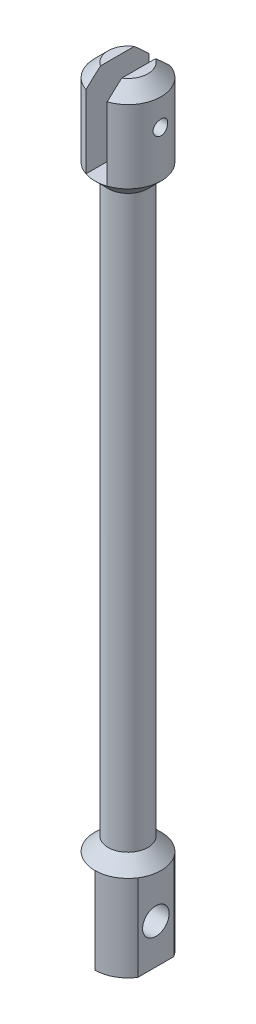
ISO-10303-21;
HEADER;
FILE_DESCRIPTION(('STEP AP214'),'2;1');
FILE_NAME('part.step','',(''),(''),'','','');
FILE_SCHEMA(('AUTOMOTIVE_DESIGN { 1 0 10303 214 1 1 1 1 }'));
ENDSEC;
DATA;
#1=APPLICATION_CONTEXT('core data for automotive mechanical design processes');
#2=APPLICATION_PROTOCOL_DEFINITION('international standard','automotive_design',2000,#1);
#3=PRODUCT_CONTEXT('',#1,'mechanical');
#4=PRODUCT('Part','Part','',(#3));
#5=PRODUCT_RELATED_PRODUCT_CATEGORY('part','',(#4));
#6=PRODUCT_DEFINITION_FORMATION('','',#4);
#7=PRODUCT_DEFINITION_CONTEXT('part definition',#1,'design');
#8=PRODUCT_DEFINITION('design','',#6,#7);
#9=PRODUCT_DEFINITION_SHAPE('','',#8);
#10=(LENGTH_UNIT() NAMED_UNIT(*) SI_UNIT(.MILLI.,.METRE.));
#11=(NAMED_UNIT(*) PLANE_ANGLE_UNIT() SI_UNIT($,.RADIAN.));
#12=(NAMED_UNIT(*) SI_UNIT($,.STERADIAN.) SOLID_ANGLE_UNIT());
#13=UNCERTAINTY_MEASURE_WITH_UNIT(LENGTH_MEASURE(1.E-05),#10,'distance_accuracy_value','');
#14=(GEOMETRIC_REPRESENTATION_CONTEXT(3) GLOBAL_UNCERTAINTY_ASSIGNED_CONTEXT((#13)) GLOBAL_UNIT_ASSIGNED_CONTEXT((#10,
#11,#12)) REPRESENTATION_CONTEXT('',''));
#15=CARTESIAN_POINT('',(0.,0.,0.));
#16=DIRECTION('',(0.,0.,1.));
#17=DIRECTION('',(1.,0.,0.));
#18=AXIS2_PLACEMENT_3D('',#15,#16,#17);
#19=CARTESIAN_POINT('',(0.8,51.5,2.368543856));
#20=DIRECTION('',(1.,0.,0.));
#21=DIRECTION('',(0.,0.,-1.));
#22=AXIS2_PLACEMENT_3D('',#19,#20,#21);
#23=PLANE('',#22);
#24=DIRECTION('',(0.,0.,1.));
#25=VECTOR('',#24,1.);
#26=CARTESIAN_POINT('',(0.8,58.,0.));
#27=LINE('',#26,#25);
#28=CARTESIAN_POINT('',(0.8,58.0000000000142,-1.26885775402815));
#29=VERTEX_POINT('',#28);
#30=CARTESIAN_POINT('',(0.8,58.,1.26885775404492));
#31=VERTEX_POINT('',#30);
#32=EDGE_CURVE('E185',#29,#31,#27,.T.);
#33=ORIENTED_EDGE('',*,*,#32,.F.);
#34=CARTESIAN_POINT('',(0.8,58.0000000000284,-1.26885775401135));
#35=CARTESIAN_POINT('',(0.8,57.9599805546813,-1.31615088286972));
#36=CARTESIAN_POINT('',(0.8,57.9196090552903,-1.36314265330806));
#37=CARTESIAN_POINT('',(0.8,57.8383030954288,-1.45663280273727));
#38=CARTESIAN_POINT('',(0.8,57.7973686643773,-1.50313120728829));
#39=CARTESIAN_POINT('',(0.8,57.6739404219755,-1.64204184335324));
#40=CARTESIAN_POINT('',(0.8,57.5908078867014,-1.73388558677));
#41=CARTESIAN_POINT('',(0.8,57.4234828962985,-1.91657711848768));
#42=CARTESIAN_POINT('',(0.8,57.3392905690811,-2.00742502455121));
#43=CARTESIAN_POINT('',(0.8,57.1701383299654,-2.18843350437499));
#44=CARTESIAN_POINT('',(0.8,57.0851782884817,-2.27859395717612));
#45=CARTESIAN_POINT('',(0.8,56.9999999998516,-2.36854385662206));
#46=B_SPLINE_CURVE_WITH_KNOTS('',3,(#34,#35,#36,#37,#38,#39,#40,#41,#42,#43,#44,#45),
.UNSPECIFIED.,.F.,.F.,(4,2,2,2,2,4),(0.,0.185853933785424,0.371698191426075,0.743323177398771,
1.11490373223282,1.48654822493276),.UNSPECIFIED.);
#47=CARTESIAN_POINT('',(0.799999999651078,56.9999999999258,-2.36854385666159));
#48=VERTEX_POINT('',#47);
#49=EDGE_CURVE('E269',#29,#48,#46,.T.);
#50=ORIENTED_EDGE('',*,*,#49,.T.);
#51=DIRECTION('',(0.,1.,0.));
#52=VECTOR('',#51,1.);
#53=CARTESIAN_POINT('',(0.799999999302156,54.25,-2.36854385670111));
#54=LINE('',#53,#52);
#55=CARTESIAN_POINT('',(0.800000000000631,51.5,-2.36854385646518));
#56=VERTEX_POINT('',#55);
#57=EDGE_CURVE('E423',#48,#56,#54,.F.);
#58=ORIENTED_EDGE('',*,*,#57,.T.);
#59=DIRECTION('',(0.,0.,-1.));
#60=VECTOR('',#59,1.);
#61=CARTESIAN_POINT('',(0.8,51.5,0.));
#62=LINE('',#61,#60);
#63=CARTESIAN_POINT('',(0.800000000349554,51.5,2.36854385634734));
#64=VERTEX_POINT('',#63);
#65=EDGE_CURVE('E191',#64,#56,#62,.T.);
#66=ORIENTED_EDGE('',*,*,#65,.F.);
#67=DIRECTION('',(0.,-1.,0.));
#68=VECTOR('',#67,1.);
#69=CARTESIAN_POINT('',(0.800000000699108,54.25,2.36854385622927));
#70=LINE('',#69,#68);
#71=CARTESIAN_POINT('',(0.800000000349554,57.0000000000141,2.36854385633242));
#72=VERTEX_POINT('',#71);
#73=EDGE_CURVE('E437',#64,#72,#70,.F.);
#74=ORIENTED_EDGE('',*,*,#73,.T.);
#75=CARTESIAN_POINT('',(0.800000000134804,57.000000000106,2.36854385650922));
#76=CARTESIAN_POINT('',(0.800000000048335,57.0851782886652,2.27859395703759));
#77=CARTESIAN_POINT('',(0.800000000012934,57.1701383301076,2.18843350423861));
#78=CARTESIAN_POINT('',(0.799999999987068,57.3392905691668,2.00742502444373));
#79=CARTESIAN_POINT('',(0.799999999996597,57.4234828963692,1.91657711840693));
#80=CARTESIAN_POINT('',(0.800000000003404,57.5908078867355,1.73388558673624));
#81=CARTESIAN_POINT('',(0.800000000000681,57.6739404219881,1.64204184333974));
#82=CARTESIAN_POINT('',(0.79999999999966,57.7973686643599,1.50313120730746));
#83=CARTESIAN_POINT('',(0.79999999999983,57.8383030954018,1.45663280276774));
#84=CARTESIAN_POINT('',(0.80000000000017,57.9196090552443,1.36314265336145));
#85=CARTESIAN_POINT('',(0.800000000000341,57.959980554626,1.31615088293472));
#86=CARTESIAN_POINT('',(0.8,57.9999999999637,1.26885775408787));
#87=B_SPLINE_CURVE_WITH_KNOTS('',3,(#75,#76,#77,#78,#79,#80,#81,#82,#83,#84,#85,#86),
.UNSPECIFIED.,.F.,.F.,(4,2,2,2,2,4),(0.,0.3716444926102,0.743225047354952,1.11485003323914,
1.30069429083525,1.486548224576),.UNSPECIFIED.);
#88=EDGE_CURVE('E274',#72,#31,#87,.T.);
#89=ORIENTED_EDGE('',*,*,#88,.T.);
#90=EDGE_LOOP('',(#33,#50,#58,#66,#74,#89));
#91=FACE_BOUND('',#90,.T.);
#92=CARTESIAN_POINT('',(0.799999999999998,55.,0.));
#93=DIRECTION('',(-1.,0.,0.));
#94=DIRECTION('',(0.,0.,1.));
#95=AXIS2_PLACEMENT_3D('',#92,#93,#94);
#96=CIRCLE('',#95,0.549999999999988);
#97=CARTESIAN_POINT('',(0.799999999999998,55.,0.549999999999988));
#98=VERTEX_POINT('',#97);
#99=EDGE_CURVE('E361',#98,#98,#96,.T.);
#100=ORIENTED_EDGE('',*,*,#99,.F.);
#101=EDGE_LOOP('',(#100));
#102=FACE_BOUND('',#101,.T.);
#103=ADVANCED_FACE('F42',(#91,#102),#23,.F.);
#104=CARTESIAN_POINT('',(2.1,6.5,1.372743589));
#105=DIRECTION('',(0.,-1.,0.));
#106=DIRECTION('',(0.,0.,-1.));
#107=AXIS2_PLACEMENT_3D('',#104,#105,#106);
#108=PLANE('',#107);
#109=DIRECTION('',(0.,0.,1.));
#110=VECTOR('',#109,1.);
#111=CARTESIAN_POINT('',(2.1,6.5,1.35646599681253));
#112=LINE('',#111,#110);
#113=CARTESIAN_POINT('',(2.1,6.5,-1.35646599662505));
#114=VERTEX_POINT('',#113);
#115=CARTESIAN_POINT('',(2.1,6.5,1.35646599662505));
#116=VERTEX_POINT('',#115);
#117=EDGE_CURVE('E63',#114,#116,#112,.T.);
#118=ORIENTED_EDGE('',*,*,#117,.F.);
#119=CARTESIAN_POINT('',(0.,6.5,0.));
#120=DIRECTION('',(0.,-1.,0.));
#121=DIRECTION('',(0.,0.,-1.));
#122=AXIS2_PLACEMENT_3D('',#119,#120,#121);
#123=CIRCLE('',#122,2.5);
#124=EDGE_CURVE('E56',#116,#114,#123,.F.);
#125=ORIENTED_EDGE('',*,*,#124,.F.);
#126=EDGE_LOOP('',(#118,#125));
#127=FACE_BOUND('',#126,.T.);
#128=ADVANCED_FACE('F266',(#127),#108,.T.);
#129=CARTESIAN_POINT('',(-1.5042,58.,-1.284084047));
#130=DIRECTION('',(0.,1.,0.));
#131=DIRECTION('',(0.,0.,1.));
#132=AXIS2_PLACEMENT_3D('',#129,#130,#131);
#133=PLANE('',#132);
#134=CARTESIAN_POINT('',(0.,58.,0.));
#135=DIRECTION('',(0.,-1.,0.));
#136=DIRECTION('',(0.,0.,-1.));
#137=AXIS2_PLACEMENT_3D('',#134,#135,#136);
#138=CIRCLE('',#137,1.49999999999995);
#139=CARTESIAN_POINT('',(-0.8,57.9999999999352,-1.26885775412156));
#140=VERTEX_POINT('',#139);
#141=CARTESIAN_POINT('',(-0.8,58.,1.26885775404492));
#142=VERTEX_POINT('',#141);
#143=EDGE_CURVE('E325',#140,#142,#138,.F.);
#144=ORIENTED_EDGE('',*,*,#143,.T.);
#145=DIRECTION('',(0.,0.,1.));
#146=VECTOR('',#145,1.);
#147=CARTESIAN_POINT('',(-0.8,58.,0.));
#148=LINE('',#147,#146);
#149=EDGE_CURVE('E242',#140,#142,#148,.T.);
#150=ORIENTED_EDGE('',*,*,#149,.F.);
#151=EDGE_LOOP('',(#144,#150));
#152=FACE_BOUND('',#151,.T.);
#153=ADVANCED_FACE('F385',(#152),#133,.T.);
#154=CARTESIAN_POINT('',(-0.8,51.5,-2.53));
#155=DIRECTION('',(0.,1.,0.));
#156=DIRECTION('',(0.,0.,1.));
#157=AXIS2_PLACEMENT_3D('',#154,#155,#156);
#158=PLANE('',#157);
#159=ORIENTED_EDGE('',*,*,#65,.T.);
#160=CARTESIAN_POINT('',(0.,51.5,0.));
#161=DIRECTION('',(0.,1.,0.));
#162=DIRECTION('',(-1.,0.,0.));
#163=AXIS2_PLACEMENT_3D('',#160,#161,#162);
#164=CIRCLE('',#163,2.49999999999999);
#165=CARTESIAN_POINT('',(-0.800000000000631,51.5,-2.36854385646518));
#166=VERTEX_POINT('',#165);
#167=EDGE_CURVE('E150',#56,#166,#164,.T.);
#168=ORIENTED_EDGE('',*,*,#167,.T.);
#169=DIRECTION('',(0.,0.,-1.));
#170=VECTOR('',#169,1.);
#171=CARTESIAN_POINT('',(-0.8,51.5,0.));
#172=LINE('',#171,#170);
#173=CARTESIAN_POINT('',(-0.80000000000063,51.5,2.36854385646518));
#174=VERTEX_POINT('',#173);
#175=EDGE_CURVE('E317',#174,#166,#172,.T.);
#176=ORIENTED_EDGE('',*,*,#175,.F.);
#177=CARTESIAN_POINT('',(0.,51.5,0.));
#178=DIRECTION('',(0.,1.,0.));
#179=DIRECTION('',(-1.,0.,0.));
#180=AXIS2_PLACEMENT_3D('',#177,#178,#179);
#181=CIRCLE('',#180,2.49999999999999);
#182=EDGE_CURVE('E147',#174,#64,#181,.T.);
#183=ORIENTED_EDGE('',*,*,#182,.T.);
#184=EDGE_LOOP('',(#159,#168,#176,#183));
#185=FACE_BOUND('',#184,.T.);
#186=ADVANCED_FACE('F411',(#185),#158,.T.);
#187=CARTESIAN_POINT('',(0.8,58.,-1.284084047));
#188=DIRECTION('',(0.,1.,0.));
#189=DIRECTION('',(0.,0.,1.));
#190=AXIS2_PLACEMENT_3D('',#187,#188,#189);
#191=PLANE('',#190);
#192=ORIENTED_EDGE('',*,*,#32,.T.);
#193=CARTESIAN_POINT('',(0.,58.,0.));
#194=DIRECTION('',(0.,-1.,0.));
#195=DIRECTION('',(0.,0.,-1.));
#196=AXIS2_PLACEMENT_3D('',#193,#194,#195);
#197=CIRCLE('',#196,1.49999999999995);
#198=EDGE_CURVE('E190',#31,#29,#197,.F.);
#199=ORIENTED_EDGE('',*,*,#198,.T.);
#200=EDGE_LOOP('',(#192,#199));
#201=FACE_BOUND('',#200,.T.);
#202=ADVANCED_FACE('F261',(#201),#191,.T.);
#203=CARTESIAN_POINT('',(0.,58.,0.));
#204=DIRECTION('',(0.,-1.,0.));
#205=DIRECTION('',(0.,0.,-1.));
#206=AXIS2_PLACEMENT_3D('',#203,#204,#205);
#207=CONICAL_SURFACE('',#206,1.5,0.785398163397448);
#208=CARTESIAN_POINT('',(-0.799999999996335,57.9999999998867,1.26885775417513));
#209=CARTESIAN_POINT('',(-0.799999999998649,57.9599805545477,1.31615088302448));
#210=CARTESIAN_POINT('',(-0.79999999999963,57.9196090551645,1.36314265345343));
#211=CARTESIAN_POINT('',(-0.80000000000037,57.8383030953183,1.45663280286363));
#212=CARTESIAN_POINT('',(-0.80000000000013,57.7973686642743,1.50313120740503));
#213=CARTESIAN_POINT('',(-0.799999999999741,57.6739404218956,1.6420418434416));
#214=CARTESIAN_POINT('',(-0.799999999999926,57.5908078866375,1.73388558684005));
#215=CARTESIAN_POINT('',(-0.800000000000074,57.4234828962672,1.91657711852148));
#216=CARTESIAN_POINT('',(-0.800000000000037,57.3392905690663,2.00742502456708));
#217=CARTESIAN_POINT('',(-0.799999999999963,57.1701383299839,2.18843350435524));
#218=CARTESIAN_POINT('',(-0.799999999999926,57.0851782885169,2.27859395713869));
#219=CARTESIAN_POINT('',(-0.8,56.9999999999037,2.36854385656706));
#220=B_SPLINE_CURVE_WITH_KNOTS('',3,(#208,#209,#210,#211,#212,#213,#214,#215,#216,#217,#218,
#219),.UNSPECIFIED.,.F.,.F.,(4,2,2,2,2,4),(0.,0.185853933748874,0.371698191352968,
0.743323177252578,1.11490373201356,1.48654822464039),.UNSPECIFIED.);
#221=CARTESIAN_POINT('',(-0.800000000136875,56.9999999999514,2.36854385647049));
#222=VERTEX_POINT('',#221);
#223=EDGE_CURVE('E232',#142,#222,#220,.T.);
#224=ORIENTED_EDGE('',*,*,#223,.F.);
#225=ORIENTED_EDGE('',*,*,#143,.F.);
#226=CARTESIAN_POINT('',(-0.8,56.9999999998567,-2.36854385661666));
#227=CARTESIAN_POINT('',(-0.8,57.0851782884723,-2.27859395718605));
#228=CARTESIAN_POINT('',(-0.8,57.1701383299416,-2.18843350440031));
#229=CARTESIAN_POINT('',(-0.8,57.3392905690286,-2.00742502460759));
#230=CARTESIAN_POINT('',(-0.8,57.4234828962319,-1.91657711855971));
#231=CARTESIAN_POINT('',(-0.8,57.5908078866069,-1.73388558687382));
#232=CARTESIAN_POINT('',(-0.8,57.6739404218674,-1.64204184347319));
#233=CARTESIAN_POINT('',(-0.8,57.7973686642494,-1.50313120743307));
#234=CARTESIAN_POINT('',(-0.8,57.8383030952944,-1.45663280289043));
#235=CARTESIAN_POINT('',(-0.8,57.9196090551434,-1.3631426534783));
#236=CARTESIAN_POINT('',(-0.8,57.9599805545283,-1.31615088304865));
#237=CARTESIAN_POINT('',(-0.8,57.9999999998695,-1.26885775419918));
#238=B_SPLINE_CURVE_WITH_KNOTS('',3,(#226,#227,#228,#229,#230,#231,#232,#233,#234,#235,#236,
#237),.UNSPECIFIED.,.F.,.F.,(4,2,2,2,2,4),(0.,0.371644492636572,0.743225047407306,
1.11485003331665,1.30069429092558,1.4865482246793),.UNSPECIFIED.);
#239=CARTESIAN_POINT('',(-0.799999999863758,56.9999999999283,-2.36854385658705));
#240=VERTEX_POINT('',#239);
#241=EDGE_CURVE('E244',#240,#140,#238,.T.);
#242=ORIENTED_EDGE('',*,*,#241,.F.);
#243=CARTESIAN_POINT('',(0.,57.,0.));
#244=DIRECTION('',(0.,-1.,0.));
#245=DIRECTION('',(0.,0.,-1.));
#246=AXIS2_PLACEMENT_3D('',#243,#244,#245);
#247=CIRCLE('',#246,2.5);
#248=EDGE_CURVE('E424',#240,#222,#247,.F.);
#249=ORIENTED_EDGE('',*,*,#248,.T.);
#250=EDGE_LOOP('',(#224,#225,#242,#249));
#251=FACE_BOUND('',#250,.T.);
#252=ADVANCED_FACE('F251',(#251),#207,.T.);
#253=CARTESIAN_POINT('',(-0.8,51.5,2.368543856));
#254=DIRECTION('',(1.,0.,0.));
#255=DIRECTION('',(0.,0.,-1.));
#256=AXIS2_PLACEMENT_3D('',#253,#254,#255);
#257=PLANE('',#256);
#258=CARTESIAN_POINT('',(-0.799999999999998,55.,0.));
#259=DIRECTION('',(1.,0.,0.));
#260=DIRECTION('',(0.,0.,-1.));
#261=AXIS2_PLACEMENT_3D('',#258,#259,#260);
#262=CIRCLE('',#261,0.549999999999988);
#263=CARTESIAN_POINT('',(-0.799999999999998,55.,-0.549999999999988));
#264=VERTEX_POINT('',#263);
#265=EDGE_CURVE('E628',#264,#264,#262,.T.);
#266=ORIENTED_EDGE('',*,*,#265,.F.);
#267=EDGE_LOOP('',(#266));
#268=FACE_BOUND('',#267,.T.);
#269=ORIENTED_EDGE('',*,*,#149,.T.);
#270=ORIENTED_EDGE('',*,*,#223,.T.);
#271=DIRECTION('',(0.,1.,0.));
#272=VECTOR('',#271,1.);
#273=CARTESIAN_POINT('',(-0.800000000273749,54.25,2.36854385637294));
#274=LINE('',#273,#272);
#275=EDGE_CURVE('E417',#222,#174,#274,.F.);
#276=ORIENTED_EDGE('',*,*,#275,.T.);
#277=ORIENTED_EDGE('',*,*,#175,.T.);
#278=DIRECTION('',(0.,-1.,0.));
#279=VECTOR('',#278,1.);
#280=CARTESIAN_POINT('',(-0.799999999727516,54.25,-2.36854385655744));
#281=LINE('',#280,#279);
#282=EDGE_CURVE('E281',#166,#240,#281,.F.);
#283=ORIENTED_EDGE('',*,*,#282,.T.);
#284=ORIENTED_EDGE('',*,*,#241,.T.);
#285=EDGE_LOOP('',(#269,#270,#276,#277,#283,#284));
#286=FACE_BOUND('',#285,.T.);
#287=ADVANCED_FACE('F255',(#268,#286),#257,.T.);
#288=CARTESIAN_POINT('',(0.,58.,0.));
#289=DIRECTION('',(0.,-1.,0.));
#290=DIRECTION('',(0.,0.,-1.));
#291=AXIS2_PLACEMENT_3D('',#288,#289,#290);
#292=CONICAL_SURFACE('',#291,1.5,0.785398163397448);
#293=CARTESIAN_POINT('',(0.,57.,0.));
#294=DIRECTION('',(0.,-1.,0.));
#295=DIRECTION('',(0.,0.,-1.));
#296=AXIS2_PLACEMENT_3D('',#293,#294,#295);
#297=CIRCLE('',#296,2.5);
#298=EDGE_CURVE('E192',#72,#48,#297,.F.);
#299=ORIENTED_EDGE('',*,*,#298,.T.);
#300=ORIENTED_EDGE('',*,*,#49,.F.);
#301=ORIENTED_EDGE('',*,*,#198,.F.);
#302=ORIENTED_EDGE('',*,*,#88,.F.);
#303=EDGE_LOOP('',(#299,#300,#301,#302));
#304=FACE_BOUND('',#303,.T.);
#305=ADVANCED_FACE('F259',(#304),#292,.T.);
#306=CARTESIAN_POINT('',(0.,57.,0.));
#307=DIRECTION('',(0.,-1.,0.));
#308=DIRECTION('',(1.,0.,0.));
#309=AXIS2_PLACEMENT_3D('',#306,#307,#308);
#310=CYLINDRICAL_SURFACE('',#309,2.5);
#311=CARTESIAN_POINT('',(-2.43874967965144,55.,-0.549999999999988));
#312=CARTESIAN_POINT('',(-2.43875029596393,55.0304899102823,-0.549998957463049));
#313=CARTESIAN_POINT('',(-2.43932769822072,55.0609923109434,-0.54745600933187));
#314=CARTESIAN_POINT('',(-2.44157061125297,55.1211293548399,-0.537362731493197));
#315=CARTESIAN_POINT('',(-2.4432369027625,55.1507633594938,-0.529808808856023));
#316=CARTESIAN_POINT('',(-2.44745995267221,55.2082850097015,-0.509943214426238));
#317=CARTESIAN_POINT('',(-2.45001572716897,55.2361745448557,-0.497636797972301));
#318=CARTESIAN_POINT('',(-2.45572858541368,55.2894938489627,-0.468630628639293));
#319=CARTESIAN_POINT('',(-2.45888565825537,55.314923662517,-0.451930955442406));
#320=CARTESIAN_POINT('',(-2.46550566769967,55.3630365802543,-0.414308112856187));
#321=CARTESIAN_POINT('',(-2.46897255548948,55.3856715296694,-0.393324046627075));
#322=CARTESIAN_POINT('',(-2.47578698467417,55.4271303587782,-0.347859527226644));
#323=CARTESIAN_POINT('',(-2.47913451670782,55.4459539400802,-0.32337880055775));
#324=CARTESIAN_POINT('',(-2.4853761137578,55.4794464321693,-0.271292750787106));
#325=CARTESIAN_POINT('',(-2.48826497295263,55.4940689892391,-0.243656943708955));
#326=CARTESIAN_POINT('',(-2.49321907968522,55.5184444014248,-0.186246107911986));
#327=CARTESIAN_POINT('',(-2.49528442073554,55.5281978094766,-0.156471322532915));
#328=CARTESIAN_POINT('',(-2.49833086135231,55.5424064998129,-0.096128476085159));
#329=CARTESIAN_POINT('',(-2.49932862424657,55.5469432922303,-0.0655804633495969));
#330=CARTESIAN_POINT('',(-2.50018523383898,55.5508448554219,-0.00414172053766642));
#331=CARTESIAN_POINT('',(-2.50004421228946,55.5502102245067,0.026748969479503));
#332=CARTESIAN_POINT('',(-2.49865186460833,55.5438475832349,0.0874341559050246));
#333=CARTESIAN_POINT('',(-2.49741969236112,55.5382074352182,0.11723836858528));
#334=CARTESIAN_POINT('',(-2.49400533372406,55.5221339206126,0.175466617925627));
#335=CARTESIAN_POINT('',(-2.49182310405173,55.5117003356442,0.203890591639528));
#336=CARTESIAN_POINT('',(-2.4867230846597,55.4862586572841,0.258794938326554));
#337=CARTESIAN_POINT('',(-2.48379997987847,55.4712173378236,0.285259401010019));
#338=CARTESIAN_POINT('',(-2.47753859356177,55.4370119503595,0.335320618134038));
#339=CARTESIAN_POINT('',(-2.47420025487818,55.4178473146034,0.35891697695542));
#340=CARTESIAN_POINT('',(-2.4673924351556,55.3754612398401,0.403094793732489));
#341=CARTESIAN_POINT('',(-2.46392167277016,55.3521629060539,0.423602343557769));
#342=CARTESIAN_POINT('',(-2.45730594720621,55.3024219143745,0.460433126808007));
#343=CARTESIAN_POINT('',(-2.45416099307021,55.2759791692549,0.476756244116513));
#344=CARTESIAN_POINT('',(-2.4485495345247,55.220579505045,0.504788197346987));
#345=CARTESIAN_POINT('',(-2.4460851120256,55.1916152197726,0.516482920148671));
#346=CARTESIAN_POINT('',(-2.44214249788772,55.1320654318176,0.534816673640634));
#347=CARTESIAN_POINT('',(-2.44066414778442,55.10148019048,0.541456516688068));
#348=CARTESIAN_POINT('',(-2.43889341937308,55.0402324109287,0.549377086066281));
#349=CARTESIAN_POINT('',(-2.43857721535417,55.0095844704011,0.550765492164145));
#350=CARTESIAN_POINT('',(-2.43910228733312,54.9484950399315,0.548435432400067));
#351=CARTESIAN_POINT('',(-2.43994348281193,54.9180535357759,0.54471732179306));
#352=CARTESIAN_POINT('',(-2.44266606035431,54.8586169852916,0.532373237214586));
#353=CARTESIAN_POINT('',(-2.44453483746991,54.8296089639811,0.523806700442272));
#354=CARTESIAN_POINT('',(-2.44909062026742,54.7734400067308,0.502073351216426));
#355=CARTESIAN_POINT('',(-2.45177770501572,54.7462792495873,0.488906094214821));
#356=CARTESIAN_POINT('',(-2.45771959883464,54.694110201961,0.458108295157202));
#357=CARTESIAN_POINT('',(-2.46098259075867,54.6691419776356,0.440411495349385));
#358=CARTESIAN_POINT('',(-2.4676871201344,54.6224900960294,0.40114354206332));
#359=CARTESIAN_POINT('',(-2.47112867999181,54.6008068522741,0.379571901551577));
#360=CARTESIAN_POINT('',(-2.47788119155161,54.5609217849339,0.332679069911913));
#361=CARTESIAN_POINT('',(-2.48118845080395,54.5427934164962,0.307294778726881));
#362=CARTESIAN_POINT('',(-2.48723147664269,54.5110582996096,0.253778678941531));
#363=CARTESIAN_POINT('',(-2.48996727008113,54.497451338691,0.225646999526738));
#364=CARTESIAN_POINT('',(-2.49454356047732,54.4752472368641,0.167610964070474));
#365=CARTESIAN_POINT('',(-2.49638975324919,54.4666181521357,0.137719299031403));
#366=CARTESIAN_POINT('',(-2.499003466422,54.4545151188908,0.0768653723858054));
#367=CARTESIAN_POINT('',(-2.49977114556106,54.4510404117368,0.04590326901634));
#368=CARTESIAN_POINT('',(-2.50013655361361,54.4493792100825,-0.0155155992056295));
#369=CARTESIAN_POINT('',(-2.49975853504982,54.451083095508,-0.0459693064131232));
#370=CARTESIAN_POINT('',(-2.49792705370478,54.4594852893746,-0.106144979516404));
#371=CARTESIAN_POINT('',(-2.49647361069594,54.4661835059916,-0.135866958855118));
#372=CARTESIAN_POINT('',(-2.49265646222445,54.4843314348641,-0.193649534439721));
#373=CARTESIAN_POINT('',(-2.49029576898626,54.4957654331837,-0.221715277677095));
#374=CARTESIAN_POINT('',(-2.48491606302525,54.5230450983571,-0.275544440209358));
#375=CARTESIAN_POINT('',(-2.48189698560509,54.5388911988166,-0.301307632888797));
#376=CARTESIAN_POINT('',(-2.4754574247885,54.5749018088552,-0.350334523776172));
#377=CARTESIAN_POINT('',(-2.47203035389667,54.5951433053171,-0.373540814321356));
#378=CARTESIAN_POINT('',(-2.46519630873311,54.6392150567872,-0.41626478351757));
#379=CARTESIAN_POINT('',(-2.46178933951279,54.6630461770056,-0.435781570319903));
#380=CARTESIAN_POINT('',(-2.45532969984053,54.7140094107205,-0.47082773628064));
#381=CARTESIAN_POINT('',(-2.45228246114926,54.7411819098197,-0.486299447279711));
#382=CARTESIAN_POINT('',(-2.44695576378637,54.7978027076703,-0.512432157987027));
#383=CARTESIAN_POINT('',(-2.44467565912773,54.8272490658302,-0.523097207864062));
#384=CARTESIAN_POINT('',(-2.44156049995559,54.8806021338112,-0.537421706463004));
#385=CARTESIAN_POINT('',(-2.44051347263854,54.904220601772,-0.542129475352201));
#386=CARTESIAN_POINT('',(-2.43910783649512,54.9518901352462,-0.548418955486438));
#387=CARTESIAN_POINT('',(-2.43874919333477,54.9759411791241,-0.550000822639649));
#388=CARTESIAN_POINT('',(-2.43874967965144,55.,-0.549999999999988));
#389=B_SPLINE_CURVE_WITH_KNOTS('',3,(#311,#312,#313,#314,#315,#316,#317,#318,#319,#320,#321,
#322,#323,#324,#325,#326,#327,#328,#329,#330,#331,#332,#333,#334,#335,#336,#337,#338,#339,#340,
#341,#342,#343,#344,#345,#346,#347,#348,#349,#350,#351,#352,#353,#354,#355,#356,#357,#358,#359,
#360,#361,#362,#363,#364,#365,#366,#367,#368,#369,#370,#371,#372,#373,#374,#375,#376,#377,#378,
#379,#380,#381,#382,#383,#384,#385,#386,#387,#388),.UNSPECIFIED.,.T.,.F.,(4,2,2,2,2,2,2,2,2,2,2,
2,2,2,2,2,2,2,2,2,2,2,2,2,2,2,2,2,2,2,2,2,2,2,2,2,2,2,4),(0.,0.0913815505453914,
0.18282869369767,0.274175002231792,0.36551965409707,0.458266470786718,0.551020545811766,
0.644761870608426,0.738492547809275,0.830737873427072,0.922972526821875,1.01361950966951,
1.1042706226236,1.19559144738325,1.28692485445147,1.3801805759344,1.47343888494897,
1.5669794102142,1.66050489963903,1.75210193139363,1.84369259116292,1.93418402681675,
2.02468420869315,2.11659250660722,2.20851236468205,2.30216760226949,2.39581843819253,
2.48886141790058,2.58189070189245,2.67296456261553,2.76403674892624,2.85480913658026,
2.94559044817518,3.03811267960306,3.13065724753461,3.22445693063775,3.31817742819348,
3.39028790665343,3.46239478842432),.UNSPECIFIED.);
#390=CARTESIAN_POINT('',(-2.43874967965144,55.,-0.549999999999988));
#391=VERTEX_POINT('',#390);
#392=EDGE_CURVE('E46',#391,#391,#389,.T.);
#393=ORIENTED_EDGE('',*,*,#392,.T.);
#394=EDGE_LOOP('',(#393));
#395=FACE_BOUND('',#394,.T.);
#396=ORIENTED_EDGE('',*,*,#248,.F.);
#397=ORIENTED_EDGE('',*,*,#282,.F.);
#398=CARTESIAN_POINT('',(0.,51.5,0.));
#399=DIRECTION('',(0.,1.,0.));
#400=DIRECTION('',(0.,0.,1.));
#401=AXIS2_PLACEMENT_3D('',#398,#399,#400);
#402=CIRCLE('',#401,2.5);
#403=EDGE_CURVE('E312',#166,#174,#402,.T.);
#404=ORIENTED_EDGE('',*,*,#403,.T.);
#405=ORIENTED_EDGE('',*,*,#275,.F.);
#406=EDGE_LOOP('',(#396,#397,#404,#405));
#407=FACE_BOUND('',#406,.T.);
#408=ADVANCED_FACE('F285',(#395,#407),#310,.T.);
#409=CARTESIAN_POINT('',(0.,57.,0.));
#410=DIRECTION('',(0.,-1.,0.));
#411=DIRECTION('',(1.,0.,0.));
#412=AXIS2_PLACEMENT_3D('',#409,#410,#411);
#413=CYLINDRICAL_SURFACE('',#412,2.5);
#414=CARTESIAN_POINT('',(2.43874967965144,55.,0.549999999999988));
#415=CARTESIAN_POINT('',(2.43875029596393,55.0304899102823,0.549998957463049));
#416=CARTESIAN_POINT('',(2.43932769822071,55.0609923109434,0.54745600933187));
#417=CARTESIAN_POINT('',(2.44157061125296,55.1211293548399,0.537362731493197));
#418=CARTESIAN_POINT('',(2.44323690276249,55.1507633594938,0.529808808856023));
#419=CARTESIAN_POINT('',(2.4474599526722,55.2082850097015,0.509943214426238));
#420=CARTESIAN_POINT('',(2.45001572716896,55.2361745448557,0.497636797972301));
#421=CARTESIAN_POINT('',(2.45572858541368,55.2894938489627,0.468630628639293));
#422=CARTESIAN_POINT('',(2.45888565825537,55.314923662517,0.451930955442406));
#423=CARTESIAN_POINT('',(2.46550566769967,55.3630365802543,0.414308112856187));
#424=CARTESIAN_POINT('',(2.46897255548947,55.3856715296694,0.393324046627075));
#425=CARTESIAN_POINT('',(2.47578698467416,55.4271303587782,0.347859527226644));
#426=CARTESIAN_POINT('',(2.47913451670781,55.4459539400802,0.32337880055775));
#427=CARTESIAN_POINT('',(2.4853761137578,55.4794464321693,0.271292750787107));
#428=CARTESIAN_POINT('',(2.48826497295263,55.4940689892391,0.243656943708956));
#429=CARTESIAN_POINT('',(2.49321907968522,55.5184444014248,0.186246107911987));
#430=CARTESIAN_POINT('',(2.49528442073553,55.5281978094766,0.156471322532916));
#431=CARTESIAN_POINT('',(2.4983308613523,55.5424064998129,0.0961284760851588));
#432=CARTESIAN_POINT('',(2.49932862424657,55.5469432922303,0.0655804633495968));
#433=CARTESIAN_POINT('',(2.50018523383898,55.5508448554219,0.00414172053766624));
#434=CARTESIAN_POINT('',(2.50004421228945,55.5502102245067,-0.0267489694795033));
#435=CARTESIAN_POINT('',(2.49865186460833,55.5438475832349,-0.0874341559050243));
#436=CARTESIAN_POINT('',(2.49741969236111,55.5382074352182,-0.117238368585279));
#437=CARTESIAN_POINT('',(2.49400533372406,55.5221339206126,-0.175466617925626));
#438=CARTESIAN_POINT('',(2.49182310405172,55.5117003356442,-0.203890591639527));
#439=CARTESIAN_POINT('',(2.4867230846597,55.4862586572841,-0.258794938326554));
#440=CARTESIAN_POINT('',(2.48379997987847,55.4712173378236,-0.285259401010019));
#441=CARTESIAN_POINT('',(2.47753859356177,55.4370119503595,-0.335320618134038));
#442=CARTESIAN_POINT('',(2.47420025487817,55.4178473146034,-0.35891697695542));
#443=CARTESIAN_POINT('',(2.4673924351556,55.3754612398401,-0.403094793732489));
#444=CARTESIAN_POINT('',(2.46392167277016,55.3521629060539,-0.423602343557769));
#445=CARTESIAN_POINT('',(2.45730594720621,55.3024219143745,-0.460433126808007));
#446=CARTESIAN_POINT('',(2.4541609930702,55.2759791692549,-0.476756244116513));
#447=CARTESIAN_POINT('',(2.44854953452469,55.220579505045,-0.504788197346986));
#448=CARTESIAN_POINT('',(2.4460851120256,55.1916152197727,-0.516482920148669));
#449=CARTESIAN_POINT('',(2.44214249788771,55.1320654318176,-0.534816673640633));
#450=CARTESIAN_POINT('',(2.44066414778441,55.10148019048,-0.541456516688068));
#451=CARTESIAN_POINT('',(2.43889341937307,55.0402324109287,-0.549377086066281));
#452=CARTESIAN_POINT('',(2.43857721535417,55.0095844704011,-0.550765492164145));
#453=CARTESIAN_POINT('',(2.43910228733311,54.9484950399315,-0.548435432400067));
#454=CARTESIAN_POINT('',(2.43994348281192,54.9180535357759,-0.54471732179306));
#455=CARTESIAN_POINT('',(2.44266606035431,54.8586169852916,-0.532373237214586));
#456=CARTESIAN_POINT('',(2.4445348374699,54.8296089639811,-0.523806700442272));
#457=CARTESIAN_POINT('',(2.44909062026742,54.7734400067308,-0.502073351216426));
#458=CARTESIAN_POINT('',(2.45177770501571,54.7462792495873,-0.488906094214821));
#459=CARTESIAN_POINT('',(2.45771959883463,54.694110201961,-0.458108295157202));
#460=CARTESIAN_POINT('',(2.46098259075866,54.6691419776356,-0.440411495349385));
#461=CARTESIAN_POINT('',(2.4676871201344,54.6224900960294,-0.40114354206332));
#462=CARTESIAN_POINT('',(2.47112867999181,54.6008068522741,-0.379571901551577));
#463=CARTESIAN_POINT('',(2.4778811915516,54.5609217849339,-0.332679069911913));
#464=CARTESIAN_POINT('',(2.48118845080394,54.5427934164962,-0.307294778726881));
#465=CARTESIAN_POINT('',(2.48723147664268,54.5110582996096,-0.253778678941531));
#466=CARTESIAN_POINT('',(2.48996727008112,54.497451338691,-0.225646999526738));
#467=CARTESIAN_POINT('',(2.49454356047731,54.4752472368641,-0.167610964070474));
#468=CARTESIAN_POINT('',(2.49638975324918,54.4666181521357,-0.137719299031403));
#469=CARTESIAN_POINT('',(2.49900346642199,54.4545151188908,-0.0768653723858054));
#470=CARTESIAN_POINT('',(2.49977114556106,54.4510404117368,-0.04590326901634));
#471=CARTESIAN_POINT('',(2.5001365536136,54.4493792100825,0.0155155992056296));
#472=CARTESIAN_POINT('',(2.49975853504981,54.451083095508,0.0459693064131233));
#473=CARTESIAN_POINT('',(2.49792705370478,54.4594852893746,0.106144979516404));
#474=CARTESIAN_POINT('',(2.49647361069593,54.4661835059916,0.135866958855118));
#475=CARTESIAN_POINT('',(2.49265646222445,54.4843314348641,0.193649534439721));
#476=CARTESIAN_POINT('',(2.49029576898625,54.4957654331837,0.221715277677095));
#477=CARTESIAN_POINT('',(2.48491606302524,54.5230450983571,0.275544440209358));
#478=CARTESIAN_POINT('',(2.48189698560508,54.5388911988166,0.301307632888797));
#479=CARTESIAN_POINT('',(2.47545742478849,54.5749018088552,0.350334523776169));
#480=CARTESIAN_POINT('',(2.47203035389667,54.5951433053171,0.373540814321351));
#481=CARTESIAN_POINT('',(2.46519630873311,54.6392150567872,0.416264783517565));
#482=CARTESIAN_POINT('',(2.46178933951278,54.6630461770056,0.435781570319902));
#483=CARTESIAN_POINT('',(2.45532969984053,54.7140094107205,0.47082773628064));
#484=CARTESIAN_POINT('',(2.45228246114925,54.7411819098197,0.486299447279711));
#485=CARTESIAN_POINT('',(2.44695576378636,54.7978027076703,0.512432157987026));
#486=CARTESIAN_POINT('',(2.44467565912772,54.8272490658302,0.523097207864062));
#487=CARTESIAN_POINT('',(2.44156049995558,54.8806021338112,0.537421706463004));
#488=CARTESIAN_POINT('',(2.44051347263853,54.904220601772,0.542129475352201));
#489=CARTESIAN_POINT('',(2.43910783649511,54.9518901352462,0.548418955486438));
#490=CARTESIAN_POINT('',(2.43874919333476,54.9759411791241,0.550000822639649));
#491=CARTESIAN_POINT('',(2.43874967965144,55.,0.549999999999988));
#492=B_SPLINE_CURVE_WITH_KNOTS('',3,(#414,#415,#416,#417,#418,#419,#420,#421,#422,#423,#424,
#425,#426,#427,#428,#429,#430,#431,#432,#433,#434,#435,#436,#437,#438,#439,#440,#441,#442,#443,
#444,#445,#446,#447,#448,#449,#450,#451,#452,#453,#454,#455,#456,#457,#458,#459,#460,#461,#462,
#463,#464,#465,#466,#467,#468,#469,#470,#471,#472,#473,#474,#475,#476,#477,#478,#479,#480,#481,
#482,#483,#484,#485,#486,#487,#488,#489,#490,#491),.UNSPECIFIED.,.T.,.F.,(4,2,2,2,2,2,2,2,2,2,2,
2,2,2,2,2,2,2,2,2,2,2,2,2,2,2,2,2,2,2,2,2,2,2,2,2,2,2,4),(0.,0.0913815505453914,
0.18282869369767,0.274175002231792,0.36551965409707,0.458266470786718,0.551020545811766,
0.644761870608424,0.738492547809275,0.830737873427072,0.922972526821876,1.01361950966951,
1.10427062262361,1.19559144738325,1.28692485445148,1.3801805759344,1.47343888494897,
1.5669794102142,1.66050489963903,1.75210193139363,1.84369259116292,1.93418402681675,
2.02468420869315,2.11659250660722,2.20851236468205,2.30216760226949,2.39581843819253,
2.48886141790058,2.58189070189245,2.67296456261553,2.76403674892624,2.85480913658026,
2.94559044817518,3.03811267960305,3.13065724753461,3.22445693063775,3.31817742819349,
3.39028790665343,3.46239478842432),.UNSPECIFIED.);
#493=CARTESIAN_POINT('',(2.43874967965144,55.,0.549999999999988));
#494=VERTEX_POINT('',#493);
#495=EDGE_CURVE('E356',#494,#494,#492,.T.);
#496=ORIENTED_EDGE('',*,*,#495,.T.);
#497=EDGE_LOOP('',(#496));
#498=FACE_BOUND('',#497,.T.);
#499=ORIENTED_EDGE('',*,*,#73,.F.);
#500=CARTESIAN_POINT('',(0.,51.5,0.));
#501=DIRECTION('',(0.,1.,0.));
#502=DIRECTION('',(0.,0.,1.));
#503=AXIS2_PLACEMENT_3D('',#500,#501,#502);
#504=CIRCLE('',#503,2.5);
#505=EDGE_CURVE('E184',#64,#56,#504,.T.);
#506=ORIENTED_EDGE('',*,*,#505,.T.);
#507=ORIENTED_EDGE('',*,*,#57,.F.);
#508=ORIENTED_EDGE('',*,*,#298,.F.);
#509=EDGE_LOOP('',(#499,#506,#507,#508));
#510=FACE_BOUND('',#509,.T.);
#511=ADVANCED_FACE('F291',(#498,#510),#413,.T.);
#512=CARTESIAN_POINT('',(0.,50.5,0.));
#513=DIRECTION('',(0.,1.,0.));
#514=DIRECTION('',(-1.,0.,0.));
#515=AXIS2_PLACEMENT_3D('',#512,#513,#514);
#516=CONICAL_SURFACE('',#515,1.5,0.785398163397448);
#517=ORIENTED_EDGE('',*,*,#182,.F.);
#518=ORIENTED_EDGE('',*,*,#403,.F.);
#519=ORIENTED_EDGE('',*,*,#167,.F.);
#520=ORIENTED_EDGE('',*,*,#505,.F.);
#521=EDGE_LOOP('',(#517,#518,#519,#520));
#522=FACE_BOUND('',#521,.T.);
#523=CARTESIAN_POINT('',(0.,50.5,0.));
#524=DIRECTION('',(0.,-1.,0.));
#525=DIRECTION('',(0.,0.,-1.));
#526=AXIS2_PLACEMENT_3D('',#523,#524,#525);
#527=CIRCLE('',#526,1.5);
#528=CARTESIAN_POINT('',(0.,50.5,-1.5));
#529=VERTEX_POINT('',#528);
#530=EDGE_CURVE('E180',#529,#529,#527,.F.);
#531=ORIENTED_EDGE('',*,*,#530,.T.);
#532=EDGE_LOOP('',(#531));
#533=FACE_BOUND('',#532,.T.);
#534=ADVANCED_FACE('F391',(#522,#533),#516,.T.);
#535=CARTESIAN_POINT('',(0.,50.5,0.));
#536=DIRECTION('',(0.,-1.,0.));
#537=DIRECTION('',(1.,0.,0.));
#538=AXIS2_PLACEMENT_3D('',#535,#536,#537);
#539=CYLINDRICAL_SURFACE('',#538,1.5);
#540=CARTESIAN_POINT('',(0.,7.50000000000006,0.));
#541=DIRECTION('',(0.,-1.,0.));
#542=DIRECTION('',(0.,0.,-1.));
#543=AXIS2_PLACEMENT_3D('',#540,#541,#542);
#544=CIRCLE('',#543,1.5);
#545=CARTESIAN_POINT('',(0.,7.5,-1.5));
#546=VERTEX_POINT('',#545);
#547=EDGE_CURVE('E176',#546,#546,#544,.F.);
#548=ORIENTED_EDGE('',*,*,#547,.T.);
#549=EDGE_LOOP('',(#548));
#550=FACE_BOUND('',#549,.T.);
#551=ORIENTED_EDGE('',*,*,#530,.F.);
#552=EDGE_LOOP('',(#551));
#553=FACE_BOUND('',#552,.T.);
#554=ADVANCED_FACE('F389',(#550,#553),#539,.T.);
#555=CARTESIAN_POINT('',(0.,7.5,0.));
#556=DIRECTION('',(0.,-1.,0.));
#557=DIRECTION('',(1.,0.,0.));
#558=AXIS2_PLACEMENT_3D('',#555,#556,#557);
#559=CONICAL_SURFACE('',#558,1.5,0.785398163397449);
#560=CARTESIAN_POINT('',(6.05469259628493E-11,6.5,-2.50000000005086));
#561=VERTEX_POINT('',#560);
#562=CARTESIAN_POINT('',(6.05466198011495E-11,6.5,2.5));
#563=VERTEX_POINT('',#562);
#564=EDGE_CURVE('E13',#561,#563,#123,.F.);
#565=ORIENTED_EDGE('',*,*,#564,.T.);
#566=CARTESIAN_POINT('',(6.05466198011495E-11,6.5,0.));
#567=DIRECTION('',(0.,-1.,0.));
#568=DIRECTION('',(0.,0.,1.));
#569=AXIS2_PLACEMENT_3D('',#566,#567,#568);
#570=CIRCLE('',#569,2.50000000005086);
#571=EDGE_CURVE('E146',#116,#563,#570,.T.);
#572=ORIENTED_EDGE('',*,*,#571,.F.);
#573=ORIENTED_EDGE('',*,*,#124,.T.);
#574=CARTESIAN_POINT('',(6.05466198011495E-11,6.5,0.));
#575=DIRECTION('',(0.,-1.,0.));
#576=DIRECTION('',(0.,0.,1.));
#577=AXIS2_PLACEMENT_3D('',#574,#575,#576);
#578=CIRCLE('',#577,2.50000000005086);
#579=EDGE_CURVE('E168',#561,#114,#578,.T.);
#580=ORIENTED_EDGE('',*,*,#579,.F.);
#581=EDGE_LOOP('',(#565,#572,#573,#580));
#582=FACE_BOUND('',#581,.T.);
#583=ORIENTED_EDGE('',*,*,#547,.F.);
#584=EDGE_LOOP('',(#583));
#585=FACE_BOUND('',#584,.T.);
#586=ADVANCED_FACE('F386',(#582,#585),#559,.T.);
#587=DIRECTION('',(0.,0.,-1.));
#588=VECTOR('',#587,1.);
#589=CARTESIAN_POINT('',(6.05466198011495E-11,6.5,-2.50000000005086));
#590=LINE('',#589,#588);
#591=EDGE_CURVE('E162',#563,#561,#590,.T.);
#592=ORIENTED_EDGE('',*,*,#591,.F.);
#593=ORIENTED_EDGE('',*,*,#564,.F.);
#594=EDGE_LOOP('',(#592,#593));
#595=FACE_BOUND('',#594,.T.);
#596=ADVANCED_FACE('F44',(#595),#108,.T.);
#597=CARTESIAN_POINT('',(6.05466198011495E-11,0.,0.));
#598=DIRECTION('',(0.,1.,0.));
#599=DIRECTION('',(0.,0.,1.));
#600=AXIS2_PLACEMENT_3D('',#597,#598,#599);
#601=CYLINDRICAL_SURFACE('',#600,2.50000000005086);
#602=ORIENTED_EDGE('',*,*,#571,.T.);
#603=DIRECTION('',(0.,1.,0.));
#604=VECTOR('',#603,1.);
#605=CARTESIAN_POINT('',(6.05466198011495E-11,0.,2.50000000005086));
#606=LINE('',#605,#604);
#607=CARTESIAN_POINT('',(6.05466198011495E-11,0.,2.50000000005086));
#608=VERTEX_POINT('',#607);
#609=EDGE_CURVE('E128',#608,#563,#606,.T.);
#610=ORIENTED_EDGE('',*,*,#609,.F.);
#611=CARTESIAN_POINT('',(6.05466198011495E-11,0.,0.));
#612=DIRECTION('',(0.,-1.,0.));
#613=DIRECTION('',(0.,0.,1.));
#614=AXIS2_PLACEMENT_3D('',#611,#612,#613);
#615=CIRCLE('',#614,2.50000000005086);
#616=CARTESIAN_POINT('',(2.1,0.,1.35646599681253));
#617=VERTEX_POINT('',#616);
#618=EDGE_CURVE('E135',#617,#608,#615,.T.);
#619=ORIENTED_EDGE('',*,*,#618,.F.);
#620=DIRECTION('',(0.,1.,0.));
#621=VECTOR('',#620,1.);
#622=CARTESIAN_POINT('',(2.1,0.,1.35646599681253));
#623=LINE('',#622,#621);
#624=EDGE_CURVE('E169',#617,#116,#623,.T.);
#625=ORIENTED_EDGE('',*,*,#624,.T.);
#626=EDGE_LOOP('',(#602,#610,#619,#625));
#627=FACE_BOUND('',#626,.T.);
#628=ADVANCED_FACE('F145',(#627),#601,.T.);
#629=CARTESIAN_POINT('',(6.05466198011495E-11,0.,-2.50000000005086));
#630=DIRECTION('',(1.,0.,0.));
#631=DIRECTION('',(0.,0.,-1.));
#632=AXIS2_PLACEMENT_3D('',#629,#630,#631);
#633=PLANE('',#632);
#634=CARTESIAN_POINT('',(0.,3.,0.));
#635=DIRECTION('',(-1.,0.,0.));
#636=DIRECTION('',(0.,0.,1.));
#637=AXIS2_PLACEMENT_3D('',#634,#635,#636);
#638=CIRCLE('',#637,0.999999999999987);
#639=CARTESIAN_POINT('',(0.,3.,0.999999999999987));
#640=VERTEX_POINT('',#639);
#641=EDGE_CURVE('E355',#640,#640,#638,.T.);
#642=ORIENTED_EDGE('',*,*,#641,.F.);
#643=EDGE_LOOP('',(#642));
#644=FACE_BOUND('',#643,.T.);
#645=ORIENTED_EDGE('',*,*,#591,.T.);
#646=DIRECTION('',(0.,1.,0.));
#647=VECTOR('',#646,1.);
#648=CARTESIAN_POINT('',(6.05469259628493E-11,0.,-2.50000000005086));
#649=LINE('',#648,#647);
#650=CARTESIAN_POINT('',(6.05469259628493E-11,0.,-2.50000000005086));
#651=VERTEX_POINT('',#650);
#652=EDGE_CURVE('E131',#651,#561,#649,.T.);
#653=ORIENTED_EDGE('',*,*,#652,.F.);
#654=DIRECTION('',(0.,0.,-1.));
#655=VECTOR('',#654,1.);
#656=CARTESIAN_POINT('',(6.05466198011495E-11,0.,-2.50000000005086));
#657=LINE('',#656,#655);
#658=EDGE_CURVE('E123',#608,#651,#657,.T.);
#659=ORIENTED_EDGE('',*,*,#658,.F.);
#660=ORIENTED_EDGE('',*,*,#609,.T.);
#661=EDGE_LOOP('',(#645,#653,#659,#660));
#662=FACE_BOUND('',#661,.T.);
#663=ADVANCED_FACE('F126',(#644,#662),#633,.F.);
#664=CARTESIAN_POINT('',(6.05466198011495E-11,0.,0.));
#665=DIRECTION('',(0.,1.,0.));
#666=DIRECTION('',(0.,0.,1.));
#667=AXIS2_PLACEMENT_3D('',#664,#665,#666);
#668=CYLINDRICAL_SURFACE('',#667,2.50000000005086);
#669=ORIENTED_EDGE('',*,*,#579,.T.);
#670=DIRECTION('',(0.,1.,0.));
#671=VECTOR('',#670,1.);
#672=CARTESIAN_POINT('',(2.1,0.,-1.35646599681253));
#673=LINE('',#672,#671);
#674=CARTESIAN_POINT('',(2.1,0.,-1.35646599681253));
#675=VERTEX_POINT('',#674);
#676=EDGE_CURVE('E152',#675,#114,#673,.T.);
#677=ORIENTED_EDGE('',*,*,#676,.F.);
#678=CARTESIAN_POINT('',(6.05466198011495E-11,0.,0.));
#679=DIRECTION('',(0.,-1.,0.));
#680=DIRECTION('',(0.,0.,1.));
#681=AXIS2_PLACEMENT_3D('',#678,#679,#680);
#682=CIRCLE('',#681,2.50000000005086);
#683=EDGE_CURVE('E134',#651,#675,#682,.T.);
#684=ORIENTED_EDGE('',*,*,#683,.F.);
#685=ORIENTED_EDGE('',*,*,#652,.T.);
#686=EDGE_LOOP('',(#669,#677,#684,#685));
#687=FACE_BOUND('',#686,.T.);
#688=ADVANCED_FACE('F345',(#687),#668,.T.);
#689=CARTESIAN_POINT('',(2.1,0.,1.35646599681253));
#690=DIRECTION('',(-1.,0.,0.));
#691=DIRECTION('',(0.,0.,1.));
#692=AXIS2_PLACEMENT_3D('',#689,#690,#691);
#693=PLANE('',#692);
#694=CARTESIAN_POINT('',(2.1,3.,0.));
#695=DIRECTION('',(-1.,0.,0.));
#696=DIRECTION('',(0.,0.,1.));
#697=AXIS2_PLACEMENT_3D('',#694,#695,#696);
#698=CIRCLE('',#697,0.999999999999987);
#699=CARTESIAN_POINT('',(2.1,3.,0.999999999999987));
#700=VERTEX_POINT('',#699);
#701=EDGE_CURVE('E163',#700,#700,#698,.T.);
#702=ORIENTED_EDGE('',*,*,#701,.T.);
#703=EDGE_LOOP('',(#702));
#704=FACE_BOUND('',#703,.T.);
#705=ORIENTED_EDGE('',*,*,#117,.T.);
#706=ORIENTED_EDGE('',*,*,#624,.F.);
#707=DIRECTION('',(0.,0.,1.));
#708=VECTOR('',#707,1.);
#709=CARTESIAN_POINT('',(2.1,0.,1.35646599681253));
#710=LINE('',#709,#708);
#711=EDGE_CURVE('E140',#675,#617,#710,.T.);
#712=ORIENTED_EDGE('',*,*,#711,.F.);
#713=ORIENTED_EDGE('',*,*,#676,.T.);
#714=EDGE_LOOP('',(#705,#706,#712,#713));
#715=FACE_BOUND('',#714,.T.);
#716=ADVANCED_FACE('F348',(#704,#715),#693,.F.);
#717=CARTESIAN_POINT('',(6.05466198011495E-11,0.,0.));
#718=DIRECTION('',(0.,1.,0.));
#719=DIRECTION('',(0.,0.,1.));
#720=AXIS2_PLACEMENT_3D('',#717,#718,#719);
#721=PLANE('',#720);
#722=ORIENTED_EDGE('',*,*,#618,.T.);
#723=ORIENTED_EDGE('',*,*,#658,.T.);
#724=ORIENTED_EDGE('',*,*,#683,.T.);
#725=ORIENTED_EDGE('',*,*,#711,.T.);
#726=EDGE_LOOP('',(#722,#723,#724,#725));
#727=FACE_BOUND('',#726,.T.);
#728=ADVANCED_FACE('F138',(#727),#721,.F.);
#729=CARTESIAN_POINT('',(0.,3.,0.));
#730=DIRECTION('',(-1.,0.,0.));
#731=DIRECTION('',(0.,0.,1.));
#732=AXIS2_PLACEMENT_3D('',#729,#730,#731);
#733=CYLINDRICAL_SURFACE('',#732,0.999999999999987);
#734=ORIENTED_EDGE('',*,*,#641,.T.);
#735=EDGE_LOOP('',(#734));
#736=FACE_BOUND('',#735,.T.);
#737=ORIENTED_EDGE('',*,*,#701,.F.);
#738=EDGE_LOOP('',(#737));
#739=FACE_BOUND('',#738,.T.);
#740=ADVANCED_FACE('F367',(#736,#739),#733,.F.);
#741=CARTESIAN_POINT('',(0.8,55.,0.));
#742=DIRECTION('',(-1.,0.,0.));
#743=DIRECTION('',(0.,0.,1.));
#744=AXIS2_PLACEMENT_3D('',#741,#742,#743);
#745=CYLINDRICAL_SURFACE('',#744,0.549999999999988);
#746=ORIENTED_EDGE('',*,*,#99,.T.);
#747=EDGE_LOOP('',(#746));
#748=FACE_BOUND('',#747,.T.);
#749=ORIENTED_EDGE('',*,*,#495,.F.);
#750=EDGE_LOOP('',(#749));
#751=FACE_BOUND('',#750,.T.);
#752=ADVANCED_FACE('F362',(#748,#751),#745,.F.);
#753=CARTESIAN_POINT('',(-0.8,55.,0.));
#754=DIRECTION('',(1.,0.,0.));
#755=DIRECTION('',(0.,0.,-1.));
#756=AXIS2_PLACEMENT_3D('',#753,#754,#755);
#757=CYLINDRICAL_SURFACE('',#756,0.549999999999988);
#758=ORIENTED_EDGE('',*,*,#265,.T.);
#759=EDGE_LOOP('',(#758));
#760=FACE_BOUND('',#759,.T.);
#761=ORIENTED_EDGE('',*,*,#392,.F.);
#762=EDGE_LOOP('',(#761));
#763=FACE_BOUND('',#762,.T.);
#764=ADVANCED_FACE('F366',(#760,#763),#757,.F.);
#765=CLOSED_SHELL('',(#103,#128,#153,#186,#202,#252,#287,#305,#408,#511,#534,#554,#586,#596,
#628,#663,#688,#716,#728,#740,#752,#764));
#766=MANIFOLD_SOLID_BREP('B2',#765);
#767=ADVANCED_BREP_SHAPE_REPRESENTATION('',(#18,#766),#14);
#768=SHAPE_DEFINITION_REPRESENTATION(#9,#767);
ENDSEC;
END-ISO-10303-21;
